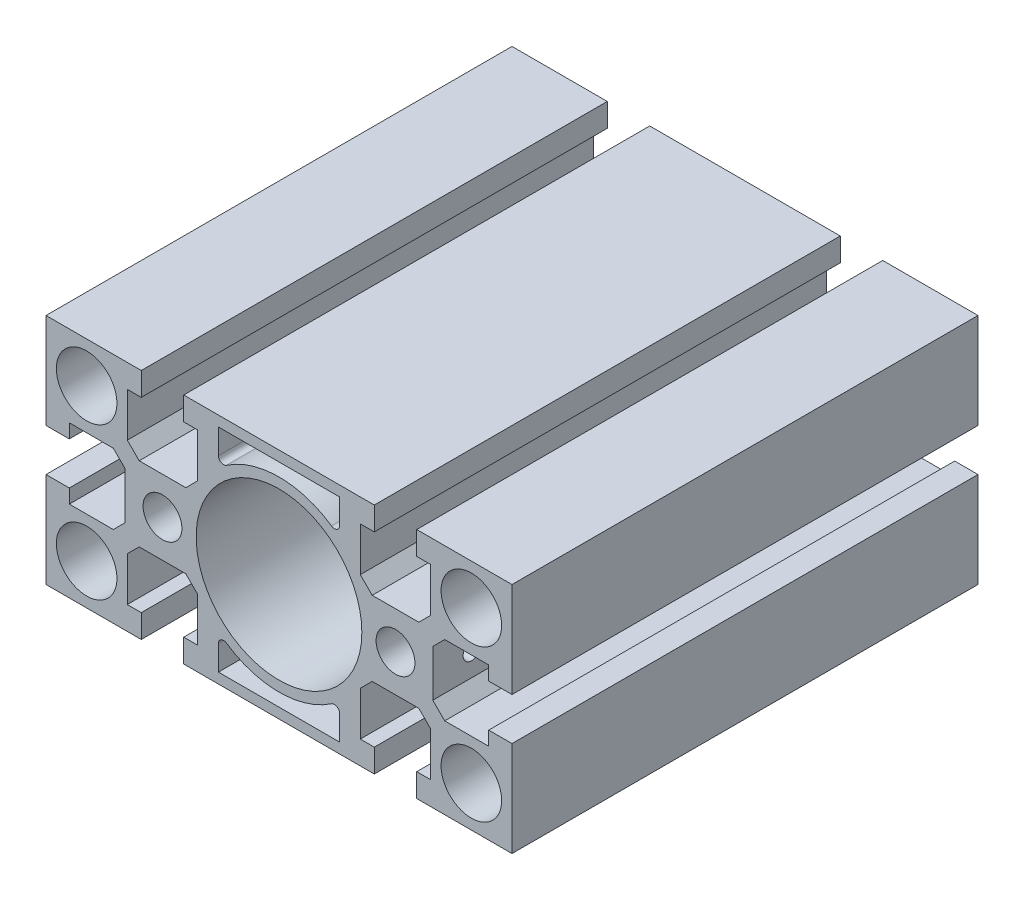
from build123d import *

# Parameters (mm, degrees)
SKETCH1_R             = 5.85
SKETCH1_R_2           = 16
SKETCH1_R_3           = 3.75
EXTRUDE1_DEPTH        = 90
M4_TAPPED_HOLE1_D     = 3.3
M4_TAPPED_HOLE1_DEPTH = 44.45
M4_TAPPED_HOLE1_TIP   = 0.991420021


with BuildPart() as part:
    # Sketch1 → Extrude1 (new body)
    with BuildSketch(Plane.XY):
        Polygon((40.5, 6.8), (40.5, 4.1), (45, 4.1), (45, 22.5), (26.6, 22.5), (26.6, 18), (29.3, 18), (29.3, 9.5), (27, 7.2), (18, 7.2), (15.7, 9.5), (15.7, 18), (18.4, 18), (18.4, 22.5), (-18.4, 22.5), (-18.4, 18), (-15.7, 18), (-15.7, 9.5), (-18, 7.2), (-27, 7.2), (-29.3, 9.5), (-29.3, 18), (-26.6, 18), (-26.6, 22.5), (-45, 22.5), (-45, 4.1), (-40.5, 4.1), (-40.5, 6.8), (-32, 6.8), (-29.7, 4.5), (-29.7, -4.5), (-32, -6.8), (-40.5, -6.8), (-40.5, -4.1), (-45, -4.1), (-45, -22.5), (-26.6, -22.5), (-26.6, -18), (-29.3, -18), (-29.3, -9.5), (-27, -7.2), (-18, -7.2), (-15.7, -9.5), (-15.7, -18), (-18.4, -18), (-18.4, -22.5), (18.4, -22.5), (18.4, -18), (15.7, -18), (15.7, -9.5), (18, -7.2), (27, -7.2), (29.3, -9.5), (29.3, -18), (26.6, -18), (26.6, -22.5), (45, -22.5), (45, -4.1), (40.5, -4.1), (40.5, -6.8), (32, -6.8), (29.7, -4.5), (29.7, 4.5), (32, 6.8), align=None)
        with Locations(Location((37.15, 14.65, 0), (0, 0, 180))):
            Circle(SKETCH1_R, mode=Mode.SUBTRACT)
        with Locations(Location((37.15, -14.65, 0), (0, 0, 180))):
            Circle(SKETCH1_R, mode=Mode.SUBTRACT)
        with Locations(Location((-37.15, -14.65, 0), (0, 0, 180))):
            Circle(SKETCH1_R, mode=Mode.SUBTRACT)
        with Locations(Location((-37.15, 14.65, 0), (0, 0, 180))):
            Circle(SKETCH1_R, mode=Mode.SUBTRACT)
        with Locations(Location((0, 0, 0), (0, 0, 180))):
            Circle(SKETCH1_R_2, mode=Mode.SUBTRACT)
        with Locations(Location((-22.5, 0, 0), (0, 0, 180))):
            Circle(SKETCH1_R_3, mode=Mode.SUBTRACT)
        with Locations(Location((22.5, 0, 0), (0, 0, 180))):
            Circle(SKETCH1_R_3, mode=Mode.SUBTRACT)
        with BuildLine():
            Line((11.7, 20.5), (11.7, 15.70063693))
            ThreePointArc((11.7, 15.70063693), (11.167355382, 14.816567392), (10.136842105, 14.874287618))
            ThreePointArc((10.136842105, 14.874287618), (0, 18), (-10.136842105, 14.874287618))
            ThreePointArc((-10.136842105, 14.874287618), (-11.167355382, 14.816567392), (-11.7, 15.70063693))
            Line((-11.7, 15.70063693), (-11.7, 20.5))
            Line((-11.7, 20.5), (11.7, 20.5))
        make_face(mode=Mode.SUBTRACT)
        with BuildLine():
            Line((11.7, -15.70063693), (11.7, -20.5))
            Line((11.7, -20.5), (-11.7, -20.5))
            Line((-11.7, -20.5), (-11.7, -15.70063693))
            ThreePointArc((-11.7, -15.70063693), (-11.167355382, -14.816567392), (-10.136842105, -14.874287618))
            ThreePointArc((-10.136842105, -14.874287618), (0, -18), (10.136842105, -14.874287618))
            ThreePointArc((10.136842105, -14.874287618), (11.167355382, -14.816567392), (11.7, -15.70063693))
        make_face(mode=Mode.SUBTRACT)
    extrude(amount=EXTRUDE1_DEPTH)

    # M4 Tapped Hole1
    with Locations(Plane(origin=(45, 0, 82.5), x_dir=(0, 0, 1), z_dir=(1, 0, 0))):
        with Locations((0, 0), (-75, 0)):
            Hole(M4_TAPPED_HOLE1_D / 2, depth=M4_TAPPED_HOLE1_DEPTH)
            with Locations((0, 0, -(M4_TAPPED_HOLE1_DEPTH + M4_TAPPED_HOLE1_TIP / 2))):  # 118° drill point
                Cone(0, M4_TAPPED_HOLE1_D / 2, M4_TAPPED_HOLE1_TIP, mode=Mode.SUBTRACT)


solid = part.part
